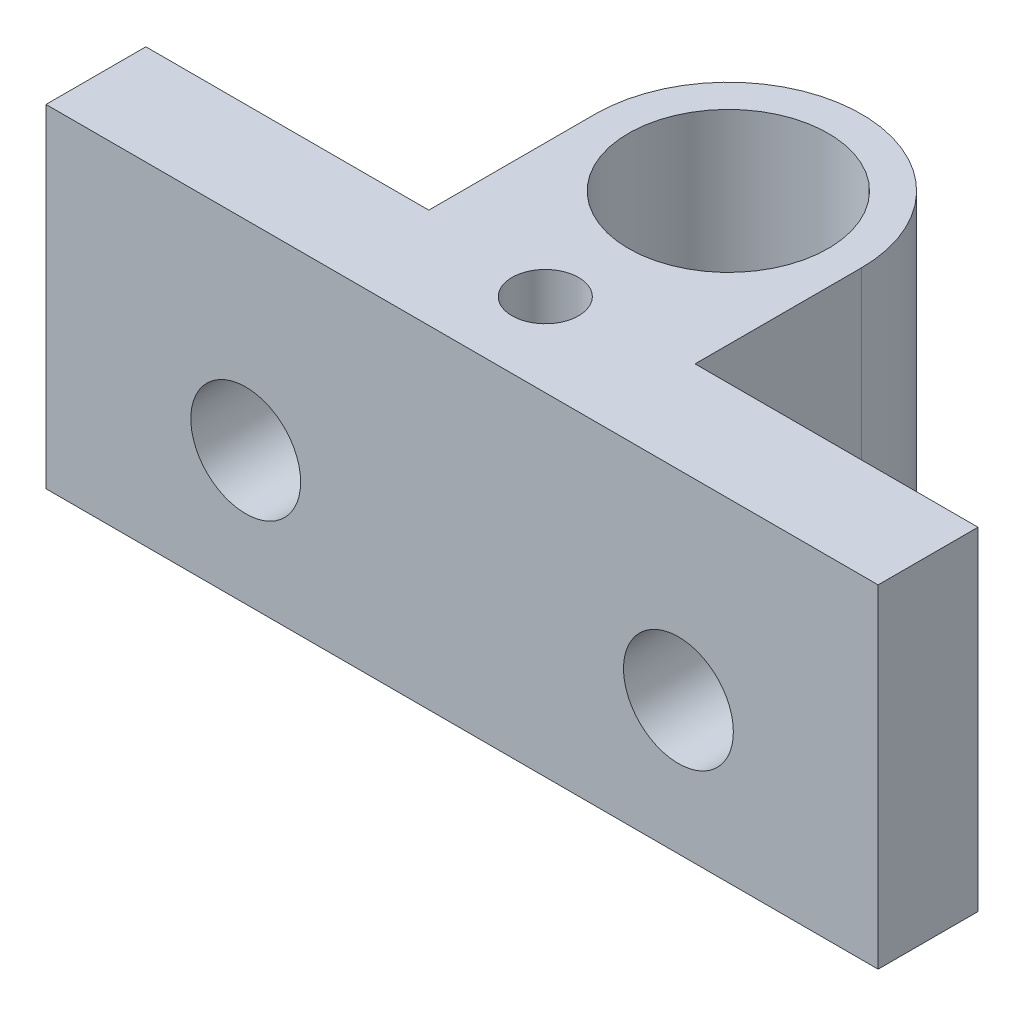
ISO-10303-21;
HEADER;
FILE_DESCRIPTION(('STEP AP214'),'2;1');
FILE_NAME('part.step','',(''),(''),'','','');
FILE_SCHEMA(('AUTOMOTIVE_DESIGN { 1 0 10303 214 1 1 1 1 }'));
ENDSEC;
DATA;
#1=APPLICATION_CONTEXT('core data for automotive mechanical design processes');
#2=APPLICATION_PROTOCOL_DEFINITION('international standard','automotive_design',2000,#1);
#3=PRODUCT_CONTEXT('',#1,'mechanical');
#4=PRODUCT('Part','Part','',(#3));
#5=PRODUCT_RELATED_PRODUCT_CATEGORY('part','',(#4));
#6=PRODUCT_DEFINITION_FORMATION('','',#4);
#7=PRODUCT_DEFINITION_CONTEXT('part definition',#1,'design');
#8=PRODUCT_DEFINITION('design','',#6,#7);
#9=PRODUCT_DEFINITION_SHAPE('','',#8);
#10=(LENGTH_UNIT() NAMED_UNIT(*) SI_UNIT(.MILLI.,.METRE.));
#11=(NAMED_UNIT(*) PLANE_ANGLE_UNIT() SI_UNIT($,.RADIAN.));
#12=(NAMED_UNIT(*) SI_UNIT($,.STERADIAN.) SOLID_ANGLE_UNIT());
#13=UNCERTAINTY_MEASURE_WITH_UNIT(LENGTH_MEASURE(1.E-05),#10,'distance_accuracy_value','');
#14=(GEOMETRIC_REPRESENTATION_CONTEXT(3) GLOBAL_UNCERTAINTY_ASSIGNED_CONTEXT((#13)) GLOBAL_UNIT_ASSIGNED_CONTEXT((#10,
#11,#12)) REPRESENTATION_CONTEXT('',''));
#15=CARTESIAN_POINT('',(0.,0.,0.));
#16=DIRECTION('',(0.,0.,1.));
#17=DIRECTION('',(1.,0.,0.));
#18=AXIS2_PLACEMENT_3D('',#15,#16,#17);
#19=CARTESIAN_POINT('',(16.5,10.,0.));
#20=DIRECTION('',(1.,0.,0.));
#21=DIRECTION('',(0.,0.,-1.));
#22=AXIS2_PLACEMENT_3D('',#19,#20,#21);
#23=PLANE('',#22);
#24=DIRECTION('',(0.,0.,1.));
#25=VECTOR('',#24,1.);
#26=CARTESIAN_POINT('',(16.5,0.,0.));
#27=LINE('',#26,#25);
#28=CARTESIAN_POINT('',(16.5,0.,-8.));
#29=VERTEX_POINT('',#28);
#30=CARTESIAN_POINT('',(16.5,0.,-3.));
#31=VERTEX_POINT('',#30);
#32=EDGE_CURVE('E134',#29,#31,#27,.T.);
#33=ORIENTED_EDGE('',*,*,#32,.F.);
#34=DIRECTION('',(0.,-1.,0.));
#35=VECTOR('',#34,1.);
#36=CARTESIAN_POINT('',(16.5,10.,-8.));
#37=LINE('',#36,#35);
#38=CARTESIAN_POINT('',(16.5,10.,-8.));
#39=VERTEX_POINT('',#38);
#40=EDGE_CURVE('E11',#39,#29,#37,.T.);
#41=ORIENTED_EDGE('',*,*,#40,.F.);
#42=DIRECTION('',(0.,0.,1.));
#43=VECTOR('',#42,1.);
#44=CARTESIAN_POINT('',(16.5,10.,0.));
#45=LINE('',#44,#43);
#46=CARTESIAN_POINT('',(16.5,10.,-3.));
#47=VERTEX_POINT('',#46);
#48=EDGE_CURVE('E155',#39,#47,#45,.T.);
#49=ORIENTED_EDGE('',*,*,#48,.T.);
#50=DIRECTION('',(0.,-1.,0.));
#51=VECTOR('',#50,1.);
#52=CARTESIAN_POINT('',(16.5,10.,-3.));
#53=LINE('',#52,#51);
#54=EDGE_CURVE('E51',#47,#31,#53,.T.);
#55=ORIENTED_EDGE('',*,*,#54,.T.);
#56=EDGE_LOOP('',(#33,#41,#49,#55));
#57=FACE_BOUND('',#56,.T.);
#58=ADVANCED_FACE('F35',(#57),#23,.T.);
#59=CARTESIAN_POINT('',(12.5,10.,-8.));
#60=DIRECTION('',(0.,-1.,0.));
#61=DIRECTION('',(0.,0.,-1.));
#62=AXIS2_PLACEMENT_3D('',#59,#60,#61);
#63=CYLINDRICAL_SURFACE('',#62,4.);
#64=CARTESIAN_POINT('',(12.5,0.,-8.));
#65=DIRECTION('',(0.,1.,0.));
#66=DIRECTION('',(0.,0.,1.));
#67=AXIS2_PLACEMENT_3D('',#64,#65,#66);
#68=CIRCLE('',#67,4.);
#69=CARTESIAN_POINT('',(8.5,0.,-8.));
#70=VERTEX_POINT('',#69);
#71=EDGE_CURVE('E136',#29,#70,#68,.T.);
#72=ORIENTED_EDGE('',*,*,#71,.T.);
#73=DIRECTION('',(0.,-1.,0.));
#74=VECTOR('',#73,1.);
#75=CARTESIAN_POINT('',(8.5,10.,-8.));
#76=LINE('',#75,#74);
#77=CARTESIAN_POINT('',(8.5,10.,-8.));
#78=VERTEX_POINT('',#77);
#79=EDGE_CURVE('E43',#78,#70,#76,.T.);
#80=ORIENTED_EDGE('',*,*,#79,.F.);
#81=CARTESIAN_POINT('',(12.5,10.,-8.));
#82=DIRECTION('',(0.,1.,0.));
#83=DIRECTION('',(0.,0.,1.));
#84=AXIS2_PLACEMENT_3D('',#81,#82,#83);
#85=CIRCLE('',#84,4.);
#86=EDGE_CURVE('E180',#39,#78,#85,.T.);
#87=ORIENTED_EDGE('',*,*,#86,.F.);
#88=ORIENTED_EDGE('',*,*,#40,.T.);
#89=EDGE_LOOP('',(#72,#80,#87,#88));
#90=FACE_BOUND('',#89,.T.);
#91=ADVANCED_FACE('F221',(#90),#63,.T.);
#92=CARTESIAN_POINT('',(8.5,10.,0.));
#93=DIRECTION('',(1.,0.,0.));
#94=DIRECTION('',(0.,0.,-1.));
#95=AXIS2_PLACEMENT_3D('',#92,#93,#94);
#96=PLANE('',#95);
#97=DIRECTION('',(0.,0.,1.));
#98=VECTOR('',#97,1.);
#99=CARTESIAN_POINT('',(8.5,0.,0.));
#100=LINE('',#99,#98);
#101=CARTESIAN_POINT('',(8.5,0.,-3.));
#102=VERTEX_POINT('',#101);
#103=EDGE_CURVE('E139',#70,#102,#100,.T.);
#104=ORIENTED_EDGE('',*,*,#103,.T.);
#105=DIRECTION('',(0.,-1.,0.));
#106=VECTOR('',#105,1.);
#107=CARTESIAN_POINT('',(8.5,10.,-3.));
#108=LINE('',#107,#106);
#109=CARTESIAN_POINT('',(8.5,10.,-3.));
#110=VERTEX_POINT('',#109);
#111=EDGE_CURVE('E161',#110,#102,#108,.T.);
#112=ORIENTED_EDGE('',*,*,#111,.F.);
#113=DIRECTION('',(0.,0.,1.));
#114=VECTOR('',#113,1.);
#115=CARTESIAN_POINT('',(8.5,10.,0.));
#116=LINE('',#115,#114);
#117=EDGE_CURVE('E169',#78,#110,#116,.T.);
#118=ORIENTED_EDGE('',*,*,#117,.F.);
#119=ORIENTED_EDGE('',*,*,#79,.T.);
#120=EDGE_LOOP('',(#104,#112,#118,#119));
#121=FACE_BOUND('',#120,.T.);
#122=ADVANCED_FACE('F167',(#121),#96,.F.);
#123=CARTESIAN_POINT('',(0.,10.,-3.));
#124=DIRECTION('',(0.,0.,-1.));
#125=DIRECTION('',(-1.,0.,0.));
#126=AXIS2_PLACEMENT_3D('',#123,#124,#125);
#127=PLANE('',#126);
#128=CARTESIAN_POINT('',(6.00001104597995,4.00000734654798,-3.));
#129=DIRECTION('',(0.,0.,-1.));
#130=DIRECTION('',(-1.,0.,0.));
#131=AXIS2_PLACEMENT_3D('',#128,#129,#130);
#132=CIRCLE('',#131,1.64999999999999);
#133=CARTESIAN_POINT('',(4.35001104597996,4.00000734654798,-3.));
#134=VERTEX_POINT('',#133);
#135=EDGE_CURVE('E190',#134,#134,#132,.T.);
#136=ORIENTED_EDGE('',*,*,#135,.F.);
#137=EDGE_LOOP('',(#136));
#138=FACE_BOUND('',#137,.T.);
#139=DIRECTION('',(1.,0.,0.));
#140=VECTOR('',#139,1.);
#141=CARTESIAN_POINT('',(0.,0.,-3.));
#142=LINE('',#141,#140);
#143=CARTESIAN_POINT('',(0.,0.,-3.));
#144=VERTEX_POINT('',#143);
#145=EDGE_CURVE('E142',#144,#102,#142,.T.);
#146=ORIENTED_EDGE('',*,*,#145,.F.);
#147=DIRECTION('',(0.,-1.,0.));
#148=VECTOR('',#147,1.);
#149=CARTESIAN_POINT('',(0.,10.,-3.));
#150=LINE('',#149,#148);
#151=CARTESIAN_POINT('',(0.,10.,-3.));
#152=VERTEX_POINT('',#151);
#153=EDGE_CURVE('E159',#152,#144,#150,.T.);
#154=ORIENTED_EDGE('',*,*,#153,.F.);
#155=DIRECTION('',(1.,0.,0.));
#156=VECTOR('',#155,1.);
#157=CARTESIAN_POINT('',(0.,10.,-3.));
#158=LINE('',#157,#156);
#159=EDGE_CURVE('E129',#152,#110,#158,.T.);
#160=ORIENTED_EDGE('',*,*,#159,.T.);
#161=ORIENTED_EDGE('',*,*,#111,.T.);
#162=EDGE_LOOP('',(#146,#154,#160,#161));
#163=FACE_BOUND('',#162,.T.);
#164=ADVANCED_FACE('F178',(#138,#163),#127,.T.);
#165=CARTESIAN_POINT('',(0.,10.,0.));
#166=DIRECTION('',(-1.,0.,0.));
#167=DIRECTION('',(0.,0.,1.));
#168=AXIS2_PLACEMENT_3D('',#165,#166,#167);
#169=PLANE('',#168);
#170=DIRECTION('',(0.,0.,-1.));
#171=VECTOR('',#170,1.);
#172=CARTESIAN_POINT('',(0.,0.,0.));
#173=LINE('',#172,#171);
#174=CARTESIAN_POINT('',(0.,0.,0.));
#175=VERTEX_POINT('',#174);
#176=EDGE_CURVE('E145',#175,#144,#173,.T.);
#177=ORIENTED_EDGE('',*,*,#176,.F.);
#178=DIRECTION('',(0.,-1.,0.));
#179=VECTOR('',#178,1.);
#180=CARTESIAN_POINT('',(0.,10.,0.));
#181=LINE('',#180,#179);
#182=CARTESIAN_POINT('',(0.,10.,0.));
#183=VERTEX_POINT('',#182);
#184=EDGE_CURVE('E122',#183,#175,#181,.T.);
#185=ORIENTED_EDGE('',*,*,#184,.F.);
#186=DIRECTION('',(0.,0.,-1.));
#187=VECTOR('',#186,1.);
#188=CARTESIAN_POINT('',(0.,10.,0.));
#189=LINE('',#188,#187);
#190=EDGE_CURVE('E112',#183,#152,#189,.T.);
#191=ORIENTED_EDGE('',*,*,#190,.T.);
#192=ORIENTED_EDGE('',*,*,#153,.T.);
#193=EDGE_LOOP('',(#177,#185,#191,#192));
#194=FACE_BOUND('',#193,.T.);
#195=ADVANCED_FACE('F235',(#194),#169,.T.);
#196=CARTESIAN_POINT('',(0.,10.,0.));
#197=DIRECTION('',(0.,0.,-1.));
#198=DIRECTION('',(-1.,0.,0.));
#199=AXIS2_PLACEMENT_3D('',#196,#197,#198);
#200=PLANE('',#199);
#201=CARTESIAN_POINT('',(6.00001104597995,4.00000734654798,0.));
#202=DIRECTION('',(0.,0.,1.));
#203=DIRECTION('',(1.,0.,0.));
#204=AXIS2_PLACEMENT_3D('',#201,#202,#203);
#205=CIRCLE('',#204,1.64999999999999);
#206=CARTESIAN_POINT('',(7.65001104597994,4.00000734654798,0.));
#207=VERTEX_POINT('',#206);
#208=EDGE_CURVE('E193',#207,#207,#205,.T.);
#209=ORIENTED_EDGE('',*,*,#208,.F.);
#210=EDGE_LOOP('',(#209));
#211=FACE_BOUND('',#210,.T.);
#212=CARTESIAN_POINT('',(19.00001104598,4.00000734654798,0.));
#213=DIRECTION('',(0.,0.,1.));
#214=DIRECTION('',(1.,0.,0.));
#215=AXIS2_PLACEMENT_3D('',#212,#213,#214);
#216=CIRCLE('',#215,1.64999999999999);
#217=CARTESIAN_POINT('',(20.6500110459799,4.00000734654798,0.));
#218=VERTEX_POINT('',#217);
#219=EDGE_CURVE('E187',#218,#218,#216,.T.);
#220=ORIENTED_EDGE('',*,*,#219,.F.);
#221=EDGE_LOOP('',(#220));
#222=FACE_BOUND('',#221,.T.);
#223=DIRECTION('',(1.,0.,0.));
#224=VECTOR('',#223,1.);
#225=CARTESIAN_POINT('',(0.,0.,0.));
#226=LINE('',#225,#224);
#227=CARTESIAN_POINT('',(25.,0.,0.));
#228=VERTEX_POINT('',#227);
#229=EDGE_CURVE('E119',#175,#228,#226,.T.);
#230=ORIENTED_EDGE('',*,*,#229,.T.);
#231=DIRECTION('',(0.,-1.,0.));
#232=VECTOR('',#231,1.);
#233=CARTESIAN_POINT('',(25.,10.,0.));
#234=LINE('',#233,#232);
#235=CARTESIAN_POINT('',(25.,10.,0.));
#236=VERTEX_POINT('',#235);
#237=EDGE_CURVE('E116',#236,#228,#234,.T.);
#238=ORIENTED_EDGE('',*,*,#237,.F.);
#239=DIRECTION('',(1.,0.,0.));
#240=VECTOR('',#239,1.);
#241=CARTESIAN_POINT('',(0.,10.,0.));
#242=LINE('',#241,#240);
#243=EDGE_CURVE('E102',#183,#236,#242,.T.);
#244=ORIENTED_EDGE('',*,*,#243,.F.);
#245=ORIENTED_EDGE('',*,*,#184,.T.);
#246=EDGE_LOOP('',(#230,#238,#244,#245));
#247=FACE_BOUND('',#246,.T.);
#248=ADVANCED_FACE('F117',(#211,#222,#247),#200,.F.);
#249=CARTESIAN_POINT('',(25.,10.,0.));
#250=DIRECTION('',(-1.,0.,0.));
#251=DIRECTION('',(0.,0.,1.));
#252=AXIS2_PLACEMENT_3D('',#249,#250,#251);
#253=PLANE('',#252);
#254=DIRECTION('',(0.,0.,-1.));
#255=VECTOR('',#254,1.);
#256=CARTESIAN_POINT('',(25.,0.,0.));
#257=LINE('',#256,#255);
#258=CARTESIAN_POINT('',(25.,0.,-3.));
#259=VERTEX_POINT('',#258);
#260=EDGE_CURVE('E150',#228,#259,#257,.T.);
#261=ORIENTED_EDGE('',*,*,#260,.T.);
#262=DIRECTION('',(0.,-1.,0.));
#263=VECTOR('',#262,1.);
#264=CARTESIAN_POINT('',(25.,10.,-3.));
#265=LINE('',#264,#263);
#266=CARTESIAN_POINT('',(25.,10.,-3.));
#267=VERTEX_POINT('',#266);
#268=EDGE_CURVE('E77',#267,#259,#265,.T.);
#269=ORIENTED_EDGE('',*,*,#268,.F.);
#270=DIRECTION('',(0.,0.,-1.));
#271=VECTOR('',#270,1.);
#272=CARTESIAN_POINT('',(25.,10.,0.));
#273=LINE('',#272,#271);
#274=EDGE_CURVE('E109',#236,#267,#273,.T.);
#275=ORIENTED_EDGE('',*,*,#274,.F.);
#276=ORIENTED_EDGE('',*,*,#237,.T.);
#277=EDGE_LOOP('',(#261,#269,#275,#276));
#278=FACE_BOUND('',#277,.T.);
#279=ADVANCED_FACE('F124',(#278),#253,.F.);
#280=CARTESIAN_POINT('',(19.00001104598,4.00000734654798,-3.));
#281=DIRECTION('',(0.,0.,-1.));
#282=DIRECTION('',(-1.,0.,0.));
#283=AXIS2_PLACEMENT_3D('',#280,#281,#282);
#284=CIRCLE('',#283,1.64999999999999);
#285=CARTESIAN_POINT('',(17.35001104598,4.00000734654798,-3.));
#286=VERTEX_POINT('',#285);
#287=EDGE_CURVE('E137',#286,#286,#284,.T.);
#288=ORIENTED_EDGE('',*,*,#287,.F.);
#289=EDGE_LOOP('',(#288));
#290=FACE_BOUND('',#289,.T.);
#291=EDGE_CURVE('E146',#31,#259,#142,.T.);
#292=ORIENTED_EDGE('',*,*,#291,.F.);
#293=ORIENTED_EDGE('',*,*,#54,.F.);
#294=EDGE_CURVE('E125',#47,#267,#158,.T.);
#295=ORIENTED_EDGE('',*,*,#294,.T.);
#296=ORIENTED_EDGE('',*,*,#268,.T.);
#297=EDGE_LOOP('',(#292,#293,#295,#296));
#298=FACE_BOUND('',#297,.T.);
#299=ADVANCED_FACE('F216',(#290,#298),#127,.T.);
#300=CARTESIAN_POINT('',(12.5,10.,-8.));
#301=DIRECTION('',(0.,-1.,0.));
#302=DIRECTION('',(0.,0.,-1.));
#303=AXIS2_PLACEMENT_3D('',#300,#301,#302);
#304=CYLINDRICAL_SURFACE('',#303,3.);
#305=CARTESIAN_POINT('',(12.5,10.,-8.));
#306=DIRECTION('',(0.,1.,0.));
#307=DIRECTION('',(0.,0.,1.));
#308=AXIS2_PLACEMENT_3D('',#305,#306,#307);
#309=CIRCLE('',#308,3.);
#310=CARTESIAN_POINT('',(12.5,10.,-5.));
#311=VERTEX_POINT('',#310);
#312=EDGE_CURVE('E127',#311,#311,#309,.T.);
#313=ORIENTED_EDGE('',*,*,#312,.T.);
#314=EDGE_LOOP('',(#313));
#315=FACE_BOUND('',#314,.T.);
#316=CARTESIAN_POINT('',(12.5,0.,-8.));
#317=DIRECTION('',(0.,1.,0.));
#318=DIRECTION('',(0.,0.,1.));
#319=AXIS2_PLACEMENT_3D('',#316,#317,#318);
#320=CIRCLE('',#319,3.);
#321=CARTESIAN_POINT('',(12.5,0.,-5.));
#322=VERTEX_POINT('',#321);
#323=EDGE_CURVE('E152',#322,#322,#320,.T.);
#324=ORIENTED_EDGE('',*,*,#323,.F.);
#325=EDGE_LOOP('',(#324));
#326=FACE_BOUND('',#325,.T.);
#327=ADVANCED_FACE('F207',(#315,#326),#304,.F.);
#328=CARTESIAN_POINT('',(0.,10.,0.));
#329=DIRECTION('',(0.,1.,0.));
#330=DIRECTION('',(0.,0.,1.));
#331=AXIS2_PLACEMENT_3D('',#328,#329,#330);
#332=PLANE('',#331);
#333=CARTESIAN_POINT('',(12.5,10.,-2.5));
#334=DIRECTION('',(0.,1.,0.));
#335=DIRECTION('',(0.,0.,1.));
#336=AXIS2_PLACEMENT_3D('',#333,#334,#335);
#337=CIRCLE('',#336,1.);
#338=CARTESIAN_POINT('',(12.5,10.,-1.5));
#339=VERTEX_POINT('',#338);
#340=EDGE_CURVE('E199',#339,#339,#337,.T.);
#341=ORIENTED_EDGE('',*,*,#340,.F.);
#342=EDGE_LOOP('',(#341));
#343=FACE_BOUND('',#342,.T.);
#344=ORIENTED_EDGE('',*,*,#48,.F.);
#345=ORIENTED_EDGE('',*,*,#86,.T.);
#346=ORIENTED_EDGE('',*,*,#117,.T.);
#347=ORIENTED_EDGE('',*,*,#159,.F.);
#348=ORIENTED_EDGE('',*,*,#190,.F.);
#349=ORIENTED_EDGE('',*,*,#243,.T.);
#350=ORIENTED_EDGE('',*,*,#274,.T.);
#351=ORIENTED_EDGE('',*,*,#294,.F.);
#352=EDGE_LOOP('',(#344,#345,#346,#347,#348,#349,#350,#351));
#353=FACE_BOUND('',#352,.T.);
#354=ORIENTED_EDGE('',*,*,#312,.F.);
#355=EDGE_LOOP('',(#354));
#356=FACE_BOUND('',#355,.T.);
#357=ADVANCED_FACE('F105',(#343,#353,#356),#332,.T.);
#358=CARTESIAN_POINT('',(0.,0.,0.));
#359=DIRECTION('',(0.,1.,0.));
#360=DIRECTION('',(0.,0.,1.));
#361=AXIS2_PLACEMENT_3D('',#358,#359,#360);
#362=PLANE('',#361);
#363=CARTESIAN_POINT('',(12.5,0.,-2.5));
#364=DIRECTION('',(0.,1.,0.));
#365=DIRECTION('',(0.,0.,1.));
#366=AXIS2_PLACEMENT_3D('',#363,#364,#365);
#367=CIRCLE('',#366,1.);
#368=CARTESIAN_POINT('',(12.5,0.,-1.5));
#369=VERTEX_POINT('',#368);
#370=EDGE_CURVE('E196',#369,#369,#367,.F.);
#371=ORIENTED_EDGE('',*,*,#370,.F.);
#372=EDGE_LOOP('',(#371));
#373=FACE_BOUND('',#372,.T.);
#374=ORIENTED_EDGE('',*,*,#32,.T.);
#375=ORIENTED_EDGE('',*,*,#291,.T.);
#376=ORIENTED_EDGE('',*,*,#260,.F.);
#377=ORIENTED_EDGE('',*,*,#229,.F.);
#378=ORIENTED_EDGE('',*,*,#176,.T.);
#379=ORIENTED_EDGE('',*,*,#145,.T.);
#380=ORIENTED_EDGE('',*,*,#103,.F.);
#381=ORIENTED_EDGE('',*,*,#71,.F.);
#382=EDGE_LOOP('',(#374,#375,#376,#377,#378,#379,#380,#381));
#383=FACE_BOUND('',#382,.T.);
#384=ORIENTED_EDGE('',*,*,#323,.T.);
#385=EDGE_LOOP('',(#384));
#386=FACE_BOUND('',#385,.T.);
#387=ADVANCED_FACE('F173',(#373,#383,#386),#362,.F.);
#388=CARTESIAN_POINT('',(19.00001104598,4.00000734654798,0.));
#389=DIRECTION('',(0.,0.,1.));
#390=DIRECTION('',(1.,0.,0.));
#391=AXIS2_PLACEMENT_3D('',#388,#389,#390);
#392=CYLINDRICAL_SURFACE('',#391,1.64999999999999);
#393=ORIENTED_EDGE('',*,*,#287,.T.);
#394=EDGE_LOOP('',(#393));
#395=FACE_BOUND('',#394,.T.);
#396=ORIENTED_EDGE('',*,*,#219,.T.);
#397=EDGE_LOOP('',(#396));
#398=FACE_BOUND('',#397,.T.);
#399=ADVANCED_FACE('F213',(#395,#398),#392,.F.);
#400=CARTESIAN_POINT('',(6.00001104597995,4.00000734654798,0.));
#401=DIRECTION('',(0.,0.,1.));
#402=DIRECTION('',(1.,0.,0.));
#403=AXIS2_PLACEMENT_3D('',#400,#401,#402);
#404=CYLINDRICAL_SURFACE('',#403,1.64999999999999);
#405=ORIENTED_EDGE('',*,*,#135,.T.);
#406=EDGE_LOOP('',(#405));
#407=FACE_BOUND('',#406,.T.);
#408=ORIENTED_EDGE('',*,*,#208,.T.);
#409=EDGE_LOOP('',(#408));
#410=FACE_BOUND('',#409,.T.);
#411=ADVANCED_FACE('F246',(#407,#410),#404,.F.);
#412=CARTESIAN_POINT('',(12.5,-0.000999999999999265,-2.5));
#413=DIRECTION('',(0.,1.,0.));
#414=DIRECTION('',(0.,0.,1.));
#415=AXIS2_PLACEMENT_3D('',#412,#413,#414);
#416=CYLINDRICAL_SURFACE('',#415,1.);
#417=ORIENTED_EDGE('',*,*,#340,.T.);
#418=EDGE_LOOP('',(#417));
#419=FACE_BOUND('',#418,.T.);
#420=ORIENTED_EDGE('',*,*,#370,.T.);
#421=EDGE_LOOP('',(#420));
#422=FACE_BOUND('',#421,.T.);
#423=ADVANCED_FACE('F203',(#419,#422),#416,.F.);
#424=CLOSED_SHELL('',(#58,#91,#122,#164,#195,#248,#279,#299,#327,#357,#387,#399,#411,#423));
#425=MANIFOLD_SOLID_BREP('B2',#424);
#426=ADVANCED_BREP_SHAPE_REPRESENTATION('',(#18,#425),#14);
#427=SHAPE_DEFINITION_REPRESENTATION(#9,#426);
ENDSEC;
END-ISO-10303-21;
